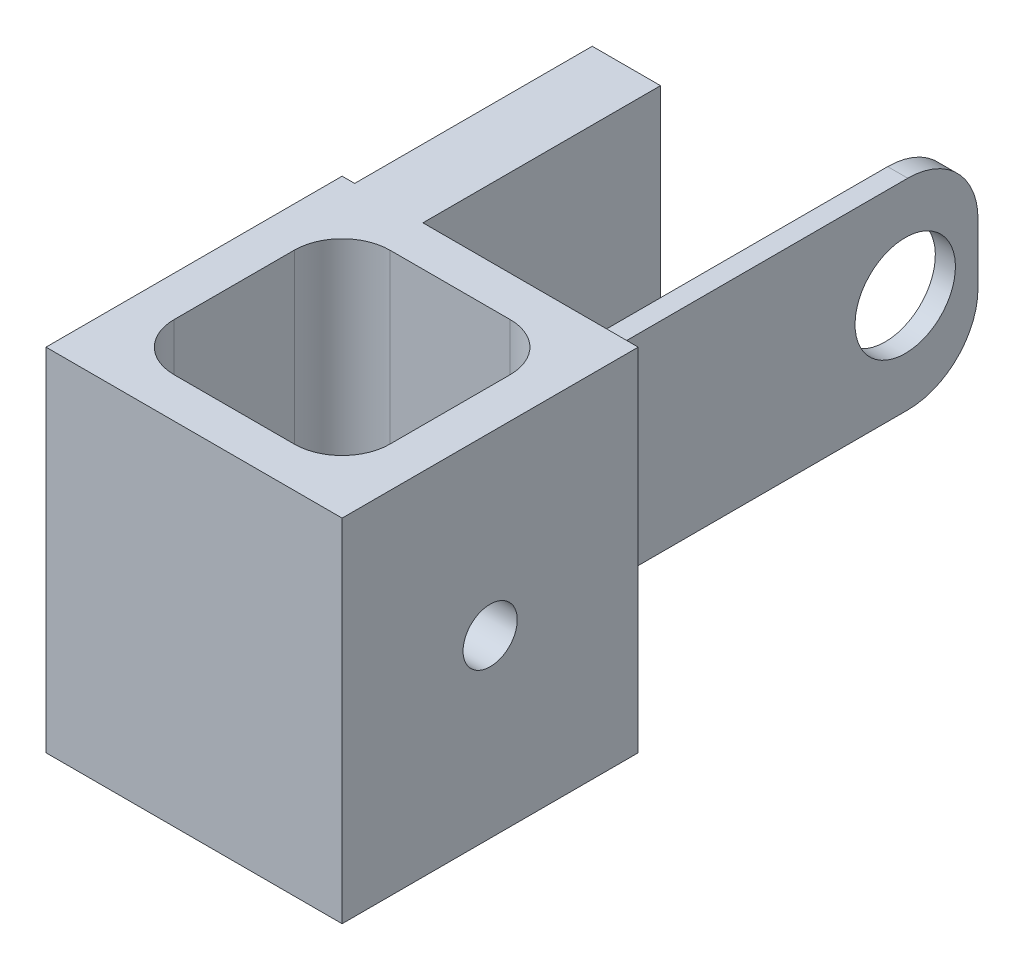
ISO-10303-21;
HEADER;
FILE_DESCRIPTION(('STEP AP214'),'2;1');
FILE_NAME('part.step','',(''),(''),'','','');
FILE_SCHEMA(('AUTOMOTIVE_DESIGN { 1 0 10303 214 1 1 1 1 }'));
ENDSEC;
DATA;
#1=APPLICATION_CONTEXT('core data for automotive mechanical design processes');
#2=APPLICATION_PROTOCOL_DEFINITION('international standard','automotive_design',2000,#1);
#3=PRODUCT_CONTEXT('',#1,'mechanical');
#4=PRODUCT('Part','Part','',(#3));
#5=PRODUCT_RELATED_PRODUCT_CATEGORY('part','',(#4));
#6=PRODUCT_DEFINITION_FORMATION('','',#4);
#7=PRODUCT_DEFINITION_CONTEXT('part definition',#1,'design');
#8=PRODUCT_DEFINITION('design','',#6,#7);
#9=PRODUCT_DEFINITION_SHAPE('','',#8);
#10=(LENGTH_UNIT() NAMED_UNIT(*) SI_UNIT(.MILLI.,.METRE.));
#11=(NAMED_UNIT(*) PLANE_ANGLE_UNIT() SI_UNIT($,.RADIAN.));
#12=(NAMED_UNIT(*) SI_UNIT($,.STERADIAN.) SOLID_ANGLE_UNIT());
#13=UNCERTAINTY_MEASURE_WITH_UNIT(LENGTH_MEASURE(1.E-05),#10,'distance_accuracy_value','');
#14=(GEOMETRIC_REPRESENTATION_CONTEXT(3) GLOBAL_UNCERTAINTY_ASSIGNED_CONTEXT((#13)) GLOBAL_UNIT_ASSIGNED_CONTEXT((#10,
#11,#12)) REPRESENTATION_CONTEXT('',''));
#15=CARTESIAN_POINT('',(0.,0.,0.));
#16=DIRECTION('',(0.,0.,1.));
#17=DIRECTION('',(1.,0.,0.));
#18=AXIS2_PLACEMENT_3D('',#15,#16,#17);
#19=CARTESIAN_POINT('',(0.,-41.7193000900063,-14.75));
#20=DIRECTION('',(0.,0.,1.));
#21=DIRECTION('',(1.,0.,0.));
#22=AXIS2_PLACEMENT_3D('',#19,#20,#21);
#23=PLANE('',#22);
#24=DIRECTION('',(0.,-1.,0.));
#25=VECTOR('',#24,1.);
#26=CARTESIAN_POINT('',(-6.70000000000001,0.,-14.75));
#27=LINE('',#26,#25);
#28=CARTESIAN_POINT('',(-6.70000000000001,35.,-14.75));
#29=VERTEX_POINT('',#28);
#30=CARTESIAN_POINT('',(-6.70000000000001,0.,-14.75));
#31=VERTEX_POINT('',#30);
#32=EDGE_CURVE('E391',#29,#31,#27,.T.);
#33=ORIENTED_EDGE('',*,*,#32,.F.);
#34=DIRECTION('',(1.,0.,0.));
#35=VECTOR('',#34,1.);
#36=CARTESIAN_POINT('',(0.,35.,-14.75));
#37=LINE('',#36,#35);
#38=CARTESIAN_POINT('',(14.75,35.,-14.75));
#39=VERTEX_POINT('',#38);
#40=EDGE_CURVE('E367',#29,#39,#37,.T.);
#41=ORIENTED_EDGE('',*,*,#40,.T.);
#42=DIRECTION('',(0.,1.,0.));
#43=VECTOR('',#42,1.);
#44=CARTESIAN_POINT('',(14.75,-41.7193000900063,-14.75));
#45=LINE('',#44,#43);
#46=CARTESIAN_POINT('',(14.75,0.,-14.75));
#47=VERTEX_POINT('',#46);
#48=EDGE_CURVE('E383',#47,#39,#45,.T.);
#49=ORIENTED_EDGE('',*,*,#48,.F.);
#50=DIRECTION('',(1.,0.,0.));
#51=VECTOR('',#50,1.);
#52=CARTESIAN_POINT('',(0.,0.,-14.75));
#53=LINE('',#52,#51);
#54=EDGE_CURVE('E348',#31,#47,#53,.T.);
#55=ORIENTED_EDGE('',*,*,#54,.F.);
#56=EDGE_LOOP('',(#33,#41,#49,#55));
#57=FACE_BOUND('',#56,.T.);
#58=DIRECTION('',(-1.,0.,0.));
#59=VECTOR('',#58,1.);
#60=CARTESIAN_POINT('',(0.,7.5,-14.75));
#61=LINE('',#60,#59);
#62=CARTESIAN_POINT('',(6.1,7.5,-14.75));
#63=VERTEX_POINT('',#62);
#64=CARTESIAN_POINT('',(4.1,7.5,-14.75));
#65=VERTEX_POINT('',#64);
#66=EDGE_CURVE('E341',#63,#65,#61,.T.);
#67=ORIENTED_EDGE('',*,*,#66,.F.);
#68=DIRECTION('',(0.,-1.,0.));
#69=VECTOR('',#68,1.);
#70=CARTESIAN_POINT('',(6.09999999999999,-41.7193000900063,-14.75));
#71=LINE('',#70,#69);
#72=CARTESIAN_POINT('',(6.1,27.5,-14.75));
#73=VERTEX_POINT('',#72);
#74=EDGE_CURVE('E11',#73,#63,#71,.T.);
#75=ORIENTED_EDGE('',*,*,#74,.F.);
#76=DIRECTION('',(1.,0.,0.));
#77=VECTOR('',#76,1.);
#78=CARTESIAN_POINT('',(0.,27.5,-14.75));
#79=LINE('',#78,#77);
#80=CARTESIAN_POINT('',(4.1,27.5,-14.75));
#81=VERTEX_POINT('',#80);
#82=EDGE_CURVE('E332',#81,#73,#79,.T.);
#83=ORIENTED_EDGE('',*,*,#82,.F.);
#84=DIRECTION('',(0.,1.,0.));
#85=VECTOR('',#84,1.);
#86=CARTESIAN_POINT('',(4.09999999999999,-41.7193000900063,-14.75));
#87=LINE('',#86,#85);
#88=EDGE_CURVE('E345',#65,#81,#87,.T.);
#89=ORIENTED_EDGE('',*,*,#88,.F.);
#90=EDGE_LOOP('',(#67,#75,#83,#89));
#91=FACE_BOUND('',#90,.T.);
#92=ADVANCED_FACE('F39',(#57,#91),#23,.F.);
#93=CARTESIAN_POINT('',(-6.70000000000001,0.,13.751));
#94=DIRECTION('',(1.,0.,0.));
#95=DIRECTION('',(0.,0.,-1.));
#96=AXIS2_PLACEMENT_3D('',#93,#94,#95);
#97=PLANE('',#96);
#98=DIRECTION('',(0.,0.,-1.));
#99=VECTOR('',#98,1.);
#100=CARTESIAN_POINT('',(-6.70000000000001,35.,13.751));
#101=LINE('',#100,#99);
#102=CARTESIAN_POINT('',(-6.70000000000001,35.,-38.42));
#103=VERTEX_POINT('',#102);
#104=EDGE_CURVE('E434',#29,#103,#101,.T.);
#105=ORIENTED_EDGE('',*,*,#104,.F.);
#106=ORIENTED_EDGE('',*,*,#32,.T.);
#107=DIRECTION('',(0.,0.,-1.));
#108=VECTOR('',#107,1.);
#109=CARTESIAN_POINT('',(-6.70000000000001,0.,13.751));
#110=LINE('',#109,#108);
#111=CARTESIAN_POINT('',(-6.70000000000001,0.,-38.42));
#112=VERTEX_POINT('',#111);
#113=EDGE_CURVE('E430',#31,#112,#110,.T.);
#114=ORIENTED_EDGE('',*,*,#113,.T.);
#115=DIRECTION('',(0.,-1.,0.));
#116=VECTOR('',#115,1.);
#117=CARTESIAN_POINT('',(-6.70000000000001,0.,-38.42));
#118=LINE('',#117,#116);
#119=EDGE_CURVE('E418',#103,#112,#118,.T.);
#120=ORIENTED_EDGE('',*,*,#119,.F.);
#121=EDGE_LOOP('',(#105,#106,#114,#120));
#122=FACE_BOUND('',#121,.T.);
#123=ADVANCED_FACE('F516',(#122),#97,.T.);
#124=CARTESIAN_POINT('',(-13.5,0.,13.751));
#125=DIRECTION('',(-1.,0.,0.));
#126=DIRECTION('',(0.,-1.,0.));
#127=AXIS2_PLACEMENT_3D('',#124,#125,#126);
#128=PLANE('',#127);
#129=DIRECTION('',(0.,0.,-1.));
#130=VECTOR('',#129,1.);
#131=CARTESIAN_POINT('',(-13.5,0.,13.751));
#132=LINE('',#131,#130);
#133=CARTESIAN_POINT('',(-13.5,0.,-14.75));
#134=VERTEX_POINT('',#133);
#135=CARTESIAN_POINT('',(-13.5,0.,-38.42));
#136=VERTEX_POINT('',#135);
#137=EDGE_CURVE('E426',#134,#136,#132,.T.);
#138=ORIENTED_EDGE('',*,*,#137,.F.);
#139=DIRECTION('',(0.,1.,0.));
#140=VECTOR('',#139,1.);
#141=CARTESIAN_POINT('',(-13.5,0.,-14.75));
#142=LINE('',#141,#140);
#143=CARTESIAN_POINT('',(-13.5,35.,-14.75));
#144=VERTEX_POINT('',#143);
#145=EDGE_CURVE('E48',#134,#144,#142,.T.);
#146=ORIENTED_EDGE('',*,*,#145,.T.);
#147=DIRECTION('',(0.,0.,-1.));
#148=VECTOR('',#147,1.);
#149=CARTESIAN_POINT('',(-13.5,35.,13.751));
#150=LINE('',#149,#148);
#151=CARTESIAN_POINT('',(-13.5,35.,-38.42));
#152=VERTEX_POINT('',#151);
#153=EDGE_CURVE('E425',#144,#152,#150,.T.);
#154=ORIENTED_EDGE('',*,*,#153,.T.);
#155=DIRECTION('',(0.,1.,0.));
#156=VECTOR('',#155,1.);
#157=CARTESIAN_POINT('',(-13.5,0.,-38.42));
#158=LINE('',#157,#156);
#159=EDGE_CURVE('E411',#136,#152,#158,.T.);
#160=ORIENTED_EDGE('',*,*,#159,.F.);
#161=EDGE_LOOP('',(#138,#146,#154,#160));
#162=FACE_BOUND('',#161,.T.);
#163=ADVANCED_FACE('F41',(#162),#128,.T.);
#164=CARTESIAN_POINT('',(-6.70000000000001,35.,13.751));
#165=DIRECTION('',(0.,1.,0.));
#166=DIRECTION('',(0.,0.,1.));
#167=AXIS2_PLACEMENT_3D('',#164,#165,#166);
#168=PLANE('',#167);
#169=ORIENTED_EDGE('',*,*,#40,.F.);
#170=ORIENTED_EDGE('',*,*,#104,.T.);
#171=DIRECTION('',(1.,0.,0.));
#172=VECTOR('',#171,1.);
#173=CARTESIAN_POINT('',(-6.70000000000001,35.,-38.42));
#174=LINE('',#173,#172);
#175=EDGE_CURVE('E415',#152,#103,#174,.T.);
#176=ORIENTED_EDGE('',*,*,#175,.F.);
#177=ORIENTED_EDGE('',*,*,#153,.F.);
#178=CARTESIAN_POINT('',(-14.75,35.,-14.75));
#179=VERTEX_POINT('',#178);
#180=EDGE_CURVE('E368',#179,#144,#37,.T.);
#181=ORIENTED_EDGE('',*,*,#180,.F.);
#182=DIRECTION('',(0.,0.,-1.));
#183=VECTOR('',#182,1.);
#184=CARTESIAN_POINT('',(-14.75,35.,0.));
#185=LINE('',#184,#183);
#186=CARTESIAN_POINT('',(-14.75,35.,14.75));
#187=VERTEX_POINT('',#186);
#188=EDGE_CURVE('E371',#187,#179,#185,.T.);
#189=ORIENTED_EDGE('',*,*,#188,.F.);
#190=DIRECTION('',(1.,0.,0.));
#191=VECTOR('',#190,1.);
#192=CARTESIAN_POINT('',(0.,35.,14.75));
#193=LINE('',#192,#191);
#194=CARTESIAN_POINT('',(14.75,35.,14.75));
#195=VERTEX_POINT('',#194);
#196=EDGE_CURVE('E360',#187,#195,#193,.T.);
#197=ORIENTED_EDGE('',*,*,#196,.T.);
#198=DIRECTION('',(0.,0.,-1.));
#199=VECTOR('',#198,1.);
#200=CARTESIAN_POINT('',(14.75,35.,0.));
#201=LINE('',#200,#199);
#202=EDGE_CURVE('E364',#195,#39,#201,.T.);
#203=ORIENTED_EDGE('',*,*,#202,.T.);
#204=EDGE_LOOP('',(#169,#170,#176,#177,#181,#189,#197,#203));
#205=FACE_BOUND('',#204,.T.);
#206=CARTESIAN_POINT('',(-5.99,35.,5.99));
#207=DIRECTION('',(0.,1.,0.));
#208=DIRECTION('',(0.,0.,-1.));
#209=AXIS2_PLACEMENT_3D('',#206,#207,#208);
#210=CIRCLE('',#209,4.76);
#211=CARTESIAN_POINT('',(-10.75,35.,5.99));
#212=VERTEX_POINT('',#211);
#213=CARTESIAN_POINT('',(-5.99,35.,10.75));
#214=VERTEX_POINT('',#213);
#215=EDGE_CURVE('E216',#212,#214,#210,.T.);
#216=ORIENTED_EDGE('',*,*,#215,.F.);
#217=DIRECTION('',(0.,0.,1.));
#218=VECTOR('',#217,1.);
#219=CARTESIAN_POINT('',(-10.75,35.,5.99));
#220=LINE('',#219,#218);
#221=CARTESIAN_POINT('',(-10.75,35.,-5.99));
#222=VERTEX_POINT('',#221);
#223=EDGE_CURVE('E254',#222,#212,#220,.T.);
#224=ORIENTED_EDGE('',*,*,#223,.F.);
#225=CARTESIAN_POINT('',(-5.99,35.,-5.99));
#226=DIRECTION('',(0.,1.,0.));
#227=DIRECTION('',(0.,0.,-1.));
#228=AXIS2_PLACEMENT_3D('',#225,#226,#227);
#229=CIRCLE('',#228,4.76);
#230=CARTESIAN_POINT('',(-5.99,35.,-10.75));
#231=VERTEX_POINT('',#230);
#232=EDGE_CURVE('E250',#231,#222,#229,.T.);
#233=ORIENTED_EDGE('',*,*,#232,.F.);
#234=DIRECTION('',(-1.,0.,0.));
#235=VECTOR('',#234,1.);
#236=CARTESIAN_POINT('',(-5.99,35.,-10.75));
#237=LINE('',#236,#235);
#238=CARTESIAN_POINT('',(5.99,35.,-10.75));
#239=VERTEX_POINT('',#238);
#240=EDGE_CURVE('E246',#239,#231,#237,.T.);
#241=ORIENTED_EDGE('',*,*,#240,.F.);
#242=CARTESIAN_POINT('',(5.99,35.,-5.98999999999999));
#243=DIRECTION('',(0.,1.,0.));
#244=DIRECTION('',(0.,0.,-1.));
#245=AXIS2_PLACEMENT_3D('',#242,#243,#244);
#246=CIRCLE('',#245,4.76);
#247=CARTESIAN_POINT('',(10.75,35.,-5.98999999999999));
#248=VERTEX_POINT('',#247);
#249=EDGE_CURVE('E242',#248,#239,#246,.T.);
#250=ORIENTED_EDGE('',*,*,#249,.F.);
#251=DIRECTION('',(0.,0.,-1.));
#252=VECTOR('',#251,1.);
#253=CARTESIAN_POINT('',(10.75,35.,5.99));
#254=LINE('',#253,#252);
#255=CARTESIAN_POINT('',(10.75,35.,5.99));
#256=VERTEX_POINT('',#255);
#257=EDGE_CURVE('E238',#256,#248,#254,.T.);
#258=ORIENTED_EDGE('',*,*,#257,.F.);
#259=CARTESIAN_POINT('',(5.99,35.,5.99));
#260=DIRECTION('',(0.,1.,0.));
#261=DIRECTION('',(0.,0.,1.));
#262=AXIS2_PLACEMENT_3D('',#259,#260,#261);
#263=CIRCLE('',#262,4.76);
#264=CARTESIAN_POINT('',(5.99,35.,10.75));
#265=VERTEX_POINT('',#264);
#266=EDGE_CURVE('E219',#265,#256,#263,.T.);
#267=ORIENTED_EDGE('',*,*,#266,.F.);
#268=DIRECTION('',(1.,0.,0.));
#269=VECTOR('',#268,1.);
#270=CARTESIAN_POINT('',(-5.99,35.,10.75));
#271=LINE('',#270,#269);
#272=EDGE_CURVE('E200',#214,#265,#271,.T.);
#273=ORIENTED_EDGE('',*,*,#272,.F.);
#274=EDGE_LOOP('',(#216,#224,#233,#241,#250,#258,#267,#273));
#275=FACE_BOUND('',#274,.T.);
#276=ADVANCED_FACE('F214',(#205,#275),#168,.T.);
#277=CARTESIAN_POINT('',(-6.70000000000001,0.,13.751));
#278=DIRECTION('',(0.,-1.,0.));
#279=DIRECTION('',(0.,0.,-1.));
#280=AXIS2_PLACEMENT_3D('',#277,#278,#279);
#281=PLANE('',#280);
#282=ORIENTED_EDGE('',*,*,#113,.F.);
#283=ORIENTED_EDGE('',*,*,#54,.T.);
#284=DIRECTION('',(0.,0.,-1.));
#285=VECTOR('',#284,1.);
#286=CARTESIAN_POINT('',(14.75,0.,0.));
#287=LINE('',#286,#285);
#288=CARTESIAN_POINT('',(14.75,0.,14.75));
#289=VERTEX_POINT('',#288);
#290=EDGE_CURVE('E379',#289,#47,#287,.T.);
#291=ORIENTED_EDGE('',*,*,#290,.F.);
#292=DIRECTION('',(1.,0.,0.));
#293=VECTOR('',#292,1.);
#294=CARTESIAN_POINT('',(0.,0.,14.75));
#295=LINE('',#294,#293);
#296=CARTESIAN_POINT('',(-14.75,0.,14.75));
#297=VERTEX_POINT('',#296);
#298=EDGE_CURVE('E356',#297,#289,#295,.T.);
#299=ORIENTED_EDGE('',*,*,#298,.F.);
#300=DIRECTION('',(0.,0.,-1.));
#301=VECTOR('',#300,1.);
#302=CARTESIAN_POINT('',(-14.75,0.,0.));
#303=LINE('',#302,#301);
#304=CARTESIAN_POINT('',(-14.75,0.,-14.75));
#305=VERTEX_POINT('',#304);
#306=EDGE_CURVE('E352',#297,#305,#303,.T.);
#307=ORIENTED_EDGE('',*,*,#306,.T.);
#308=EDGE_CURVE('E349',#305,#134,#53,.T.);
#309=ORIENTED_EDGE('',*,*,#308,.T.);
#310=ORIENTED_EDGE('',*,*,#137,.T.);
#311=DIRECTION('',(-1.,0.,0.));
#312=VECTOR('',#311,1.);
#313=CARTESIAN_POINT('',(-6.70000000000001,0.,-38.42));
#314=LINE('',#313,#312);
#315=EDGE_CURVE('E422',#112,#136,#314,.T.);
#316=ORIENTED_EDGE('',*,*,#315,.F.);
#317=EDGE_LOOP('',(#282,#283,#291,#299,#307,#309,#310,#316));
#318=FACE_BOUND('',#317,.T.);
#319=DIRECTION('',(0.,0.,1.));
#320=VECTOR('',#319,1.);
#321=CARTESIAN_POINT('',(-10.75,0.,5.99));
#322=LINE('',#321,#320);
#323=CARTESIAN_POINT('',(-10.75,0.,-5.99));
#324=VERTEX_POINT('',#323);
#325=CARTESIAN_POINT('',(-10.75,0.,5.99));
#326=VERTEX_POINT('',#325);
#327=EDGE_CURVE('E226',#324,#326,#322,.T.);
#328=ORIENTED_EDGE('',*,*,#327,.T.);
#329=CARTESIAN_POINT('',(-5.99,0.,5.99));
#330=DIRECTION('',(0.,1.,0.));
#331=DIRECTION('',(0.,0.,-1.));
#332=AXIS2_PLACEMENT_3D('',#329,#330,#331);
#333=CIRCLE('',#332,4.76);
#334=CARTESIAN_POINT('',(-5.99,0.,10.75));
#335=VERTEX_POINT('',#334);
#336=EDGE_CURVE('E257',#326,#335,#333,.T.);
#337=ORIENTED_EDGE('',*,*,#336,.T.);
#338=DIRECTION('',(1.,0.,0.));
#339=VECTOR('',#338,1.);
#340=CARTESIAN_POINT('',(-5.99,0.,10.75));
#341=LINE('',#340,#339);
#342=CARTESIAN_POINT('',(5.99,0.,10.75));
#343=VERTEX_POINT('',#342);
#344=EDGE_CURVE('E203',#335,#343,#341,.T.);
#345=ORIENTED_EDGE('',*,*,#344,.T.);
#346=CARTESIAN_POINT('',(5.99,0.,5.99));
#347=DIRECTION('',(0.,1.,0.));
#348=DIRECTION('',(0.,0.,1.));
#349=AXIS2_PLACEMENT_3D('',#346,#347,#348);
#350=CIRCLE('',#349,4.76);
#351=CARTESIAN_POINT('',(10.75,0.,5.99));
#352=VERTEX_POINT('',#351);
#353=EDGE_CURVE('E262',#343,#352,#350,.T.);
#354=ORIENTED_EDGE('',*,*,#353,.T.);
#355=DIRECTION('',(0.,0.,-1.));
#356=VECTOR('',#355,1.);
#357=CARTESIAN_POINT('',(10.75,0.,5.99));
#358=LINE('',#357,#356);
#359=CARTESIAN_POINT('',(10.75,0.,-5.98999999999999));
#360=VERTEX_POINT('',#359);
#361=EDGE_CURVE('E266',#352,#360,#358,.T.);
#362=ORIENTED_EDGE('',*,*,#361,.T.);
#363=CARTESIAN_POINT('',(5.99,0.,-5.98999999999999));
#364=DIRECTION('',(0.,1.,0.));
#365=DIRECTION('',(0.,0.,-1.));
#366=AXIS2_PLACEMENT_3D('',#363,#364,#365);
#367=CIRCLE('',#366,4.76);
#368=CARTESIAN_POINT('',(5.99,0.,-10.75));
#369=VERTEX_POINT('',#368);
#370=EDGE_CURVE('E270',#360,#369,#367,.T.);
#371=ORIENTED_EDGE('',*,*,#370,.T.);
#372=DIRECTION('',(-1.,0.,0.));
#373=VECTOR('',#372,1.);
#374=CARTESIAN_POINT('',(-5.99,0.,-10.75));
#375=LINE('',#374,#373);
#376=CARTESIAN_POINT('',(-5.99,0.,-10.75));
#377=VERTEX_POINT('',#376);
#378=EDGE_CURVE('E274',#369,#377,#375,.T.);
#379=ORIENTED_EDGE('',*,*,#378,.T.);
#380=CARTESIAN_POINT('',(-5.99,0.,-5.99));
#381=DIRECTION('',(0.,1.,0.));
#382=DIRECTION('',(0.,0.,-1.));
#383=AXIS2_PLACEMENT_3D('',#380,#381,#382);
#384=CIRCLE('',#383,4.76);
#385=EDGE_CURVE('E231',#377,#324,#384,.T.);
#386=ORIENTED_EDGE('',*,*,#385,.T.);
#387=EDGE_LOOP('',(#328,#337,#345,#354,#362,#371,#379,#386));
#388=FACE_BOUND('',#387,.T.);
#389=ADVANCED_FACE('F459',(#318,#388),#281,.T.);
#390=CARTESIAN_POINT('',(0.,0.,-38.42));
#391=DIRECTION('',(0.,0.,1.));
#392=DIRECTION('',(1.,0.,0.));
#393=AXIS2_PLACEMENT_3D('',#390,#391,#392);
#394=PLANE('',#393);
#395=CARTESIAN_POINT('',(-10.1,32.,-38.42));
#396=DIRECTION('',(0.,0.,-1.));
#397=DIRECTION('',(-1.,0.,0.));
#398=AXIS2_PLACEMENT_3D('',#395,#396,#397);
#399=CIRCLE('',#398,1.1303);
#400=CARTESIAN_POINT('',(-11.2303,32.,-38.42));
#401=VERTEX_POINT('',#400);
#402=EDGE_CURVE('E395',#401,#401,#399,.T.);
#403=ORIENTED_EDGE('',*,*,#402,.F.);
#404=EDGE_LOOP('',(#403));
#405=FACE_BOUND('',#404,.T.);
#406=CARTESIAN_POINT('',(-10.1,3.,-38.42));
#407=DIRECTION('',(0.,0.,-1.));
#408=DIRECTION('',(-1.,0.,0.));
#409=AXIS2_PLACEMENT_3D('',#406,#407,#408);
#410=CIRCLE('',#409,1.1303);
#411=CARTESIAN_POINT('',(-11.2303,3.,-38.42));
#412=VERTEX_POINT('',#411);
#413=EDGE_CURVE('E403',#412,#412,#410,.T.);
#414=ORIENTED_EDGE('',*,*,#413,.F.);
#415=EDGE_LOOP('',(#414));
#416=FACE_BOUND('',#415,.T.);
#417=ORIENTED_EDGE('',*,*,#159,.T.);
#418=ORIENTED_EDGE('',*,*,#175,.T.);
#419=ORIENTED_EDGE('',*,*,#119,.T.);
#420=ORIENTED_EDGE('',*,*,#315,.T.);
#421=EDGE_LOOP('',(#417,#418,#419,#420));
#422=FACE_BOUND('',#421,.T.);
#423=ADVANCED_FACE('F457',(#405,#416,#422),#394,.F.);
#424=CARTESIAN_POINT('',(-10.1,3.,-18.42));
#425=DIRECTION('',(0.,0.,-1.));
#426=DIRECTION('',(-1.,0.,0.));
#427=AXIS2_PLACEMENT_3D('',#424,#425,#426);
#428=CONICAL_SURFACE('',#427,1.1303,1.02974425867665);
#429=CARTESIAN_POINT('',(-10.1,3.,-17.7408472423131));
#430=VERTEX_POINT('',#429);
#431=VERTEX_LOOP('',#430);
#432=FACE_BOUND('',#431,.T.);
#433=CARTESIAN_POINT('',(-10.1,3.,-18.42));
#434=DIRECTION('',(0.,0.,-1.));
#435=DIRECTION('',(-1.,0.,0.));
#436=AXIS2_PLACEMENT_3D('',#433,#434,#435);
#437=CIRCLE('',#436,1.1303);
#438=CARTESIAN_POINT('',(-11.2303,3.,-18.42));
#439=VERTEX_POINT('',#438);
#440=EDGE_CURVE('E407',#439,#439,#437,.T.);
#441=ORIENTED_EDGE('',*,*,#440,.T.);
#442=EDGE_LOOP('',(#441));
#443=FACE_BOUND('',#442,.T.);
#444=ADVANCED_FACE('F533',(#432,#443),#428,.F.);
#445=CARTESIAN_POINT('',(-10.1,3.,-38.42));
#446=DIRECTION('',(0.,0.,-1.));
#447=DIRECTION('',(-1.,0.,0.));
#448=AXIS2_PLACEMENT_3D('',#445,#446,#447);
#449=CYLINDRICAL_SURFACE('',#448,1.1303);
#450=ORIENTED_EDGE('',*,*,#440,.F.);
#451=EDGE_LOOP('',(#450));
#452=FACE_BOUND('',#451,.T.);
#453=ORIENTED_EDGE('',*,*,#413,.T.);
#454=EDGE_LOOP('',(#453));
#455=FACE_BOUND('',#454,.T.);
#456=ADVANCED_FACE('F538',(#452,#455),#449,.F.);
#457=CARTESIAN_POINT('',(-10.1,32.,-18.42));
#458=DIRECTION('',(0.,0.,-1.));
#459=DIRECTION('',(-1.,0.,0.));
#460=AXIS2_PLACEMENT_3D('',#457,#458,#459);
#461=CONICAL_SURFACE('',#460,1.1303,1.02974425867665);
#462=CARTESIAN_POINT('',(-10.1,32.,-17.7408472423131));
#463=VERTEX_POINT('',#462);
#464=VERTEX_LOOP('',#463);
#465=FACE_BOUND('',#464,.T.);
#466=CARTESIAN_POINT('',(-10.1,32.,-18.42));
#467=DIRECTION('',(0.,0.,-1.));
#468=DIRECTION('',(-1.,0.,0.));
#469=AXIS2_PLACEMENT_3D('',#466,#467,#468);
#470=CIRCLE('',#469,1.1303);
#471=CARTESIAN_POINT('',(-11.2303,32.,-18.42));
#472=VERTEX_POINT('',#471);
#473=EDGE_CURVE('E399',#472,#472,#470,.T.);
#474=ORIENTED_EDGE('',*,*,#473,.T.);
#475=EDGE_LOOP('',(#474));
#476=FACE_BOUND('',#475,.T.);
#477=ADVANCED_FACE('F546',(#465,#476),#461,.F.);
#478=CARTESIAN_POINT('',(-10.1,32.,-38.42));
#479=DIRECTION('',(0.,0.,-1.));
#480=DIRECTION('',(-1.,0.,0.));
#481=AXIS2_PLACEMENT_3D('',#478,#479,#480);
#482=CYLINDRICAL_SURFACE('',#481,1.1303);
#483=ORIENTED_EDGE('',*,*,#473,.F.);
#484=EDGE_LOOP('',(#483));
#485=FACE_BOUND('',#484,.T.);
#486=ORIENTED_EDGE('',*,*,#402,.T.);
#487=EDGE_LOOP('',(#486));
#488=FACE_BOUND('',#487,.T.);
#489=ADVANCED_FACE('F550',(#485,#488),#482,.F.);
#490=CARTESIAN_POINT('',(14.75,-41.7193000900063,0.));
#491=DIRECTION('',(1.,0.,0.));
#492=DIRECTION('',(0.,0.,-1.));
#493=AXIS2_PLACEMENT_3D('',#490,#491,#492);
#494=PLANE('',#493);
#495=CARTESIAN_POINT('',(14.75,17.5,0.));
#496=DIRECTION('',(-1.,0.,0.));
#497=DIRECTION('',(0.,0.,1.));
#498=AXIS2_PLACEMENT_3D('',#495,#496,#497);
#499=CIRCLE('',#498,2.7);
#500=CARTESIAN_POINT('',(14.75,17.5,2.7));
#501=VERTEX_POINT('',#500);
#502=EDGE_CURVE('E338',#501,#501,#499,.T.);
#503=ORIENTED_EDGE('',*,*,#502,.T.);
#504=EDGE_LOOP('',(#503));
#505=FACE_BOUND('',#504,.T.);
#506=DIRECTION('',(0.,1.,0.));
#507=VECTOR('',#506,1.);
#508=CARTESIAN_POINT('',(14.75,-41.7193000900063,14.75));
#509=LINE('',#508,#507);
#510=EDGE_CURVE('E375',#289,#195,#509,.T.);
#511=ORIENTED_EDGE('',*,*,#510,.F.);
#512=ORIENTED_EDGE('',*,*,#290,.T.);
#513=ORIENTED_EDGE('',*,*,#48,.T.);
#514=ORIENTED_EDGE('',*,*,#202,.F.);
#515=EDGE_LOOP('',(#511,#512,#513,#514));
#516=FACE_BOUND('',#515,.T.);
#517=ADVANCED_FACE('F471',(#505,#516),#494,.T.);
#518=ORIENTED_EDGE('',*,*,#145,.F.);
#519=ORIENTED_EDGE('',*,*,#308,.F.);
#520=DIRECTION('',(0.,1.,0.));
#521=VECTOR('',#520,1.);
#522=CARTESIAN_POINT('',(-14.75,-41.7193000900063,-14.75));
#523=LINE('',#522,#521);
#524=EDGE_CURVE('E380',#305,#179,#523,.T.);
#525=ORIENTED_EDGE('',*,*,#524,.T.);
#526=ORIENTED_EDGE('',*,*,#180,.T.);
#527=EDGE_LOOP('',(#518,#519,#525,#526));
#528=FACE_BOUND('',#527,.T.);
#529=ADVANCED_FACE('F450',(#528),#23,.F.);
#530=CARTESIAN_POINT('',(-14.75,-41.7193000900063,0.));
#531=DIRECTION('',(1.,0.,0.));
#532=DIRECTION('',(0.,0.,-1.));
#533=AXIS2_PLACEMENT_3D('',#530,#531,#532);
#534=PLANE('',#533);
#535=CARTESIAN_POINT('',(-14.75,17.5,0.));
#536=DIRECTION('',(-1.,0.,0.));
#537=DIRECTION('',(0.,0.,1.));
#538=AXIS2_PLACEMENT_3D('',#535,#536,#537);
#539=CIRCLE('',#538,2.7);
#540=CARTESIAN_POINT('',(-14.75,17.5,2.7));
#541=VERTEX_POINT('',#540);
#542=EDGE_CURVE('E640',#541,#541,#539,.T.);
#543=ORIENTED_EDGE('',*,*,#542,.F.);
#544=EDGE_LOOP('',(#543));
#545=FACE_BOUND('',#544,.T.);
#546=ORIENTED_EDGE('',*,*,#306,.F.);
#547=DIRECTION('',(0.,1.,0.));
#548=VECTOR('',#547,1.);
#549=CARTESIAN_POINT('',(-14.75,-41.7193000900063,14.75));
#550=LINE('',#549,#548);
#551=EDGE_CURVE('E376',#297,#187,#550,.T.);
#552=ORIENTED_EDGE('',*,*,#551,.T.);
#553=ORIENTED_EDGE('',*,*,#188,.T.);
#554=ORIENTED_EDGE('',*,*,#524,.F.);
#555=EDGE_LOOP('',(#546,#552,#553,#554));
#556=FACE_BOUND('',#555,.T.);
#557=ADVANCED_FACE('F465',(#545,#556),#534,.F.);
#558=CARTESIAN_POINT('',(0.,-41.7193000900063,14.75));
#559=DIRECTION('',(0.,0.,1.));
#560=DIRECTION('',(1.,0.,0.));
#561=AXIS2_PLACEMENT_3D('',#558,#559,#560);
#562=PLANE('',#561);
#563=ORIENTED_EDGE('',*,*,#551,.F.);
#564=ORIENTED_EDGE('',*,*,#298,.T.);
#565=ORIENTED_EDGE('',*,*,#510,.T.);
#566=ORIENTED_EDGE('',*,*,#196,.F.);
#567=EDGE_LOOP('',(#563,#564,#565,#566));
#568=FACE_BOUND('',#567,.T.);
#569=ADVANCED_FACE('F469',(#568),#562,.T.);
#570=CARTESIAN_POINT('',(-5.99,35.,-5.99));
#571=DIRECTION('',(0.,-1.,0.));
#572=DIRECTION('',(0.,0.,-1.));
#573=AXIS2_PLACEMENT_3D('',#570,#571,#572);
#574=CYLINDRICAL_SURFACE('',#573,4.76);
#575=ORIENTED_EDGE('',*,*,#385,.F.);
#576=DIRECTION('',(0.,-1.,0.));
#577=VECTOR('',#576,1.);
#578=CARTESIAN_POINT('',(-5.99,35.,-10.75));
#579=LINE('',#578,#577);
#580=EDGE_CURVE('E286',#231,#377,#579,.T.);
#581=ORIENTED_EDGE('',*,*,#580,.F.);
#582=ORIENTED_EDGE('',*,*,#232,.T.);
#583=DIRECTION('',(0.,-1.,0.));
#584=VECTOR('',#583,1.);
#585=CARTESIAN_POINT('',(-10.75,35.,-5.99));
#586=LINE('',#585,#584);
#587=EDGE_CURVE('E283',#222,#324,#586,.T.);
#588=ORIENTED_EDGE('',*,*,#587,.T.);
#589=EDGE_LOOP('',(#575,#581,#582,#588));
#590=FACE_BOUND('',#589,.T.);
#591=ADVANCED_FACE('F557',(#590),#574,.F.);
#592=CARTESIAN_POINT('',(-5.99,35.,-10.75));
#593=DIRECTION('',(0.,0.,1.));
#594=DIRECTION('',(1.,0.,0.));
#595=AXIS2_PLACEMENT_3D('',#592,#593,#594);
#596=PLANE('',#595);
#597=ORIENTED_EDGE('',*,*,#378,.F.);
#598=DIRECTION('',(0.,-1.,0.));
#599=VECTOR('',#598,1.);
#600=CARTESIAN_POINT('',(5.99,35.,-10.75));
#601=LINE('',#600,#599);
#602=EDGE_CURVE('E289',#239,#369,#601,.T.);
#603=ORIENTED_EDGE('',*,*,#602,.F.);
#604=ORIENTED_EDGE('',*,*,#240,.T.);
#605=ORIENTED_EDGE('',*,*,#580,.T.);
#606=EDGE_LOOP('',(#597,#603,#604,#605));
#607=FACE_BOUND('',#606,.T.);
#608=ADVANCED_FACE('F592',(#607),#596,.T.);
#609=CARTESIAN_POINT('',(5.99,35.,-5.98999999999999));
#610=DIRECTION('',(0.,-1.,0.));
#611=DIRECTION('',(0.,0.,-1.));
#612=AXIS2_PLACEMENT_3D('',#609,#610,#611);
#613=CYLINDRICAL_SURFACE('',#612,4.76);
#614=ORIENTED_EDGE('',*,*,#370,.F.);
#615=DIRECTION('',(0.,-1.,0.));
#616=VECTOR('',#615,1.);
#617=CARTESIAN_POINT('',(10.75,35.,-5.98999999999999));
#618=LINE('',#617,#616);
#619=EDGE_CURVE('E292',#248,#360,#618,.T.);
#620=ORIENTED_EDGE('',*,*,#619,.F.);
#621=ORIENTED_EDGE('',*,*,#249,.T.);
#622=ORIENTED_EDGE('',*,*,#602,.T.);
#623=EDGE_LOOP('',(#614,#620,#621,#622));
#624=FACE_BOUND('',#623,.T.);
#625=ADVANCED_FACE('F582',(#624),#613,.F.);
#626=CARTESIAN_POINT('',(5.99,35.,5.99));
#627=DIRECTION('',(0.,-1.,0.));
#628=DIRECTION('',(0.,0.,-1.));
#629=AXIS2_PLACEMENT_3D('',#626,#627,#628);
#630=CYLINDRICAL_SURFACE('',#629,4.76);
#631=ORIENTED_EDGE('',*,*,#353,.F.);
#632=DIRECTION('',(0.,-1.,0.));
#633=VECTOR('',#632,1.);
#634=CARTESIAN_POINT('',(5.99,35.,10.75));
#635=LINE('',#634,#633);
#636=EDGE_CURVE('E210',#265,#343,#635,.T.);
#637=ORIENTED_EDGE('',*,*,#636,.F.);
#638=ORIENTED_EDGE('',*,*,#266,.T.);
#639=DIRECTION('',(0.,-1.,0.));
#640=VECTOR('',#639,1.);
#641=CARTESIAN_POINT('',(10.75,35.,5.99));
#642=LINE('',#641,#640);
#643=EDGE_CURVE('E295',#256,#352,#642,.T.);
#644=ORIENTED_EDGE('',*,*,#643,.T.);
#645=EDGE_LOOP('',(#631,#637,#638,#644));
#646=FACE_BOUND('',#645,.T.);
#647=ADVANCED_FACE('F579',(#646),#630,.F.);
#648=CARTESIAN_POINT('',(-5.99,35.,10.75));
#649=DIRECTION('',(0.,0.,-1.));
#650=DIRECTION('',(-1.,0.,0.));
#651=AXIS2_PLACEMENT_3D('',#648,#649,#650);
#652=PLANE('',#651);
#653=ORIENTED_EDGE('',*,*,#344,.F.);
#654=DIRECTION('',(0.,-1.,0.));
#655=VECTOR('',#654,1.);
#656=CARTESIAN_POINT('',(-5.99,35.,10.75));
#657=LINE('',#656,#655);
#658=EDGE_CURVE('E197',#214,#335,#657,.T.);
#659=ORIENTED_EDGE('',*,*,#658,.F.);
#660=ORIENTED_EDGE('',*,*,#272,.T.);
#661=ORIENTED_EDGE('',*,*,#636,.T.);
#662=EDGE_LOOP('',(#653,#659,#660,#661));
#663=FACE_BOUND('',#662,.T.);
#664=ADVANCED_FACE('F199',(#663),#652,.T.);
#665=CARTESIAN_POINT('',(-5.99,35.,5.99));
#666=DIRECTION('',(0.,-1.,0.));
#667=DIRECTION('',(0.,0.,-1.));
#668=AXIS2_PLACEMENT_3D('',#665,#666,#667);
#669=CYLINDRICAL_SURFACE('',#668,4.76);
#670=ORIENTED_EDGE('',*,*,#336,.F.);
#671=DIRECTION('',(0.,-1.,0.));
#672=VECTOR('',#671,1.);
#673=CARTESIAN_POINT('',(-10.75,35.,5.99));
#674=LINE('',#673,#672);
#675=EDGE_CURVE('E223',#212,#326,#674,.T.);
#676=ORIENTED_EDGE('',*,*,#675,.F.);
#677=ORIENTED_EDGE('',*,*,#215,.T.);
#678=ORIENTED_EDGE('',*,*,#658,.T.);
#679=EDGE_LOOP('',(#670,#676,#677,#678));
#680=FACE_BOUND('',#679,.T.);
#681=ADVANCED_FACE('F222',(#680),#669,.F.);
#682=CARTESIAN_POINT('',(-13.75,17.5,0.));
#683=DIRECTION('',(1.,0.,0.));
#684=DIRECTION('',(0.,0.,-1.));
#685=AXIS2_PLACEMENT_3D('',#682,#683,#684);
#686=CYLINDRICAL_SURFACE('',#685,2.7);
#687=CARTESIAN_POINT('',(-10.75,17.5,0.));
#688=DIRECTION('',(1.,0.,0.));
#689=DIRECTION('',(0.,0.,-1.));
#690=AXIS2_PLACEMENT_3D('',#687,#688,#689);
#691=CIRCLE('',#690,2.7);
#692=CARTESIAN_POINT('',(-10.75,17.5,-2.7));
#693=VERTEX_POINT('',#692);
#694=EDGE_CURVE('E333',#693,#693,#691,.T.);
#695=ORIENTED_EDGE('',*,*,#694,.T.);
#696=EDGE_LOOP('',(#695));
#697=FACE_BOUND('',#696,.T.);
#698=ORIENTED_EDGE('',*,*,#542,.T.);
#699=EDGE_LOOP('',(#698));
#700=FACE_BOUND('',#699,.T.);
#701=ADVANCED_FACE('F576',(#697,#700),#686,.F.);
#702=CARTESIAN_POINT('',(-10.75,35.,5.99));
#703=DIRECTION('',(1.,0.,0.));
#704=DIRECTION('',(0.,0.,-1.));
#705=AXIS2_PLACEMENT_3D('',#702,#703,#704);
#706=PLANE('',#705);
#707=ORIENTED_EDGE('',*,*,#694,.F.);
#708=EDGE_LOOP('',(#707));
#709=FACE_BOUND('',#708,.T.);
#710=ORIENTED_EDGE('',*,*,#327,.F.);
#711=ORIENTED_EDGE('',*,*,#587,.F.);
#712=ORIENTED_EDGE('',*,*,#223,.T.);
#713=ORIENTED_EDGE('',*,*,#675,.T.);
#714=EDGE_LOOP('',(#710,#711,#712,#713));
#715=FACE_BOUND('',#714,.T.);
#716=ADVANCED_FACE('F588',(#709,#715),#706,.T.);
#717=CARTESIAN_POINT('',(10.75,35.,5.99));
#718=DIRECTION('',(-1.,0.,0.));
#719=DIRECTION('',(0.,0.,1.));
#720=AXIS2_PLACEMENT_3D('',#717,#718,#719);
#721=PLANE('',#720);
#722=CARTESIAN_POINT('',(10.75,17.5,0.));
#723=DIRECTION('',(-1.,0.,0.));
#724=DIRECTION('',(0.,0.,1.));
#725=AXIS2_PLACEMENT_3D('',#722,#723,#724);
#726=CIRCLE('',#725,2.7);
#727=CARTESIAN_POINT('',(10.75,17.5,2.7));
#728=VERTEX_POINT('',#727);
#729=EDGE_CURVE('E337',#728,#728,#726,.T.);
#730=ORIENTED_EDGE('',*,*,#729,.F.);
#731=EDGE_LOOP('',(#730));
#732=FACE_BOUND('',#731,.T.);
#733=ORIENTED_EDGE('',*,*,#361,.F.);
#734=ORIENTED_EDGE('',*,*,#643,.F.);
#735=ORIENTED_EDGE('',*,*,#257,.T.);
#736=ORIENTED_EDGE('',*,*,#619,.T.);
#737=EDGE_LOOP('',(#733,#734,#735,#736));
#738=FACE_BOUND('',#737,.T.);
#739=ADVANCED_FACE('F584',(#732,#738),#721,.T.);
#740=ORIENTED_EDGE('',*,*,#729,.T.);
#741=EDGE_LOOP('',(#740));
#742=FACE_BOUND('',#741,.T.);
#743=ORIENTED_EDGE('',*,*,#502,.F.);
#744=EDGE_LOOP('',(#743));
#745=FACE_BOUND('',#744,.T.);
#746=ADVANCED_FACE('F587',(#742,#745),#686,.F.);
#747=CARTESIAN_POINT('',(6.1,27.5,-57.25));
#748=DIRECTION('',(-1.,0.,0.));
#749=DIRECTION('',(0.,-1.,0.));
#750=AXIS2_PLACEMENT_3D('',#747,#748,#749);
#751=PLANE('',#750);
#752=CARTESIAN_POINT('',(6.1,17.5,-50.));
#753=DIRECTION('',(-1.,0.,0.));
#754=DIRECTION('',(0.,-1.,0.));
#755=AXIS2_PLACEMENT_3D('',#752,#753,#754);
#756=CIRCLE('',#755,5.);
#757=CARTESIAN_POINT('',(6.1,12.5,-50.));
#758=VERTEX_POINT('',#757);
#759=EDGE_CURVE('E300',#758,#758,#756,.T.);
#760=ORIENTED_EDGE('',*,*,#759,.T.);
#761=EDGE_LOOP('',(#760));
#762=FACE_BOUND('',#761,.T.);
#763=DIRECTION('',(0.,0.,1.));
#764=VECTOR('',#763,1.);
#765=CARTESIAN_POINT('',(6.1,27.5,-57.25));
#766=LINE('',#765,#764);
#767=CARTESIAN_POINT('',(6.1,27.5,-50.25));
#768=VERTEX_POINT('',#767);
#769=EDGE_CURVE('E662',#768,#73,#766,.T.);
#770=ORIENTED_EDGE('',*,*,#769,.T.);
#771=ORIENTED_EDGE('',*,*,#74,.T.);
#772=DIRECTION('',(0.,0.,1.));
#773=VECTOR('',#772,1.);
#774=CARTESIAN_POINT('',(6.1,7.5,-57.25));
#775=LINE('',#774,#773);
#776=CARTESIAN_POINT('',(6.1,7.5,-50.25));
#777=VERTEX_POINT('',#776);
#778=EDGE_CURVE('E659',#777,#63,#775,.T.);
#779=ORIENTED_EDGE('',*,*,#778,.F.);
#780=CARTESIAN_POINT('',(6.1,14.5,-50.25));
#781=DIRECTION('',(-1.,0.,0.));
#782=DIRECTION('',(0.,-1.,0.));
#783=AXIS2_PLACEMENT_3D('',#780,#781,#782);
#784=CIRCLE('',#783,7.);
#785=CARTESIAN_POINT('',(6.1,14.5,-57.25));
#786=VERTEX_POINT('',#785);
#787=EDGE_CURVE('E325',#777,#786,#784,.F.);
#788=ORIENTED_EDGE('',*,*,#787,.T.);
#789=DIRECTION('',(0.,-1.,0.));
#790=VECTOR('',#789,1.);
#791=CARTESIAN_POINT('',(6.1,27.5,-57.25));
#792=LINE('',#791,#790);
#793=CARTESIAN_POINT('',(6.1,20.5,-57.25));
#794=VERTEX_POINT('',#793);
#795=EDGE_CURVE('E655',#794,#786,#792,.T.);
#796=ORIENTED_EDGE('',*,*,#795,.F.);
#797=CARTESIAN_POINT('',(6.1,20.5,-50.25));
#798=DIRECTION('',(-1.,0.,0.));
#799=DIRECTION('',(0.,-1.,0.));
#800=AXIS2_PLACEMENT_3D('',#797,#798,#799);
#801=CIRCLE('',#800,7.);
#802=EDGE_CURVE('E321',#794,#768,#801,.F.);
#803=ORIENTED_EDGE('',*,*,#802,.T.);
#804=EDGE_LOOP('',(#770,#771,#779,#788,#796,#803));
#805=FACE_BOUND('',#804,.T.);
#806=ADVANCED_FACE('F611',(#762,#805),#751,.F.);
#807=CARTESIAN_POINT('',(4.1,7.5,-57.25));
#808=DIRECTION('',(1.,0.,0.));
#809=DIRECTION('',(0.,1.,0.));
#810=AXIS2_PLACEMENT_3D('',#807,#808,#809);
#811=PLANE('',#810);
#812=CARTESIAN_POINT('',(4.1,17.5,-50.));
#813=DIRECTION('',(-1.,0.,0.));
#814=DIRECTION('',(0.,-1.,0.));
#815=AXIS2_PLACEMENT_3D('',#812,#813,#814);
#816=CIRCLE('',#815,5.);
#817=CARTESIAN_POINT('',(4.1,12.5,-50.));
#818=VERTEX_POINT('',#817);
#819=EDGE_CURVE('E305',#818,#818,#816,.T.);
#820=ORIENTED_EDGE('',*,*,#819,.F.);
#821=EDGE_LOOP('',(#820));
#822=FACE_BOUND('',#821,.T.);
#823=DIRECTION('',(0.,0.,1.));
#824=VECTOR('',#823,1.);
#825=CARTESIAN_POINT('',(4.1,7.5,-57.25));
#826=LINE('',#825,#824);
#827=CARTESIAN_POINT('',(4.1,7.5,-50.25));
#828=VERTEX_POINT('',#827);
#829=EDGE_CURVE('E55',#828,#65,#826,.T.);
#830=ORIENTED_EDGE('',*,*,#829,.T.);
#831=ORIENTED_EDGE('',*,*,#88,.T.);
#832=DIRECTION('',(0.,0.,1.));
#833=VECTOR('',#832,1.);
#834=CARTESIAN_POINT('',(4.1,27.5,-57.25));
#835=LINE('',#834,#833);
#836=CARTESIAN_POINT('',(4.1,27.5,-50.25));
#837=VERTEX_POINT('',#836);
#838=EDGE_CURVE('E63',#837,#81,#835,.T.);
#839=ORIENTED_EDGE('',*,*,#838,.F.);
#840=CARTESIAN_POINT('',(4.1,20.5,-50.25));
#841=DIRECTION('',(1.,0.,0.));
#842=DIRECTION('',(0.,1.,0.));
#843=AXIS2_PLACEMENT_3D('',#840,#841,#842);
#844=CIRCLE('',#843,7.);
#845=CARTESIAN_POINT('',(4.1,20.5,-57.25));
#846=VERTEX_POINT('',#845);
#847=EDGE_CURVE('E311',#837,#846,#844,.F.);
#848=ORIENTED_EDGE('',*,*,#847,.T.);
#849=DIRECTION('',(0.,1.,0.));
#850=VECTOR('',#849,1.);
#851=CARTESIAN_POINT('',(4.1,7.5,-57.25));
#852=LINE('',#851,#850);
#853=CARTESIAN_POINT('',(4.1,14.5,-57.25));
#854=VERTEX_POINT('',#853);
#855=EDGE_CURVE('E304',#854,#846,#852,.T.);
#856=ORIENTED_EDGE('',*,*,#855,.F.);
#857=CARTESIAN_POINT('',(4.1,14.5,-50.25));
#858=DIRECTION('',(1.,0.,0.));
#859=DIRECTION('',(0.,1.,0.));
#860=AXIS2_PLACEMENT_3D('',#857,#858,#859);
#861=CIRCLE('',#860,7.);
#862=EDGE_CURVE('E315',#854,#828,#861,.F.);
#863=ORIENTED_EDGE('',*,*,#862,.T.);
#864=EDGE_LOOP('',(#830,#831,#839,#848,#856,#863));
#865=FACE_BOUND('',#864,.T.);
#866=ADVANCED_FACE('F607',(#822,#865),#811,.F.);
#867=CARTESIAN_POINT('',(4.1,7.5,-57.25));
#868=DIRECTION('',(0.,1.,0.));
#869=DIRECTION('',(0.,0.,1.));
#870=AXIS2_PLACEMENT_3D('',#867,#868,#869);
#871=PLANE('',#870);
#872=ORIENTED_EDGE('',*,*,#778,.T.);
#873=ORIENTED_EDGE('',*,*,#66,.T.);
#874=ORIENTED_EDGE('',*,*,#829,.F.);
#875=DIRECTION('',(-1.,0.,0.));
#876=VECTOR('',#875,1.);
#877=CARTESIAN_POINT('',(6.1,7.5,-50.25));
#878=LINE('',#877,#876);
#879=EDGE_CURVE('E318',#828,#777,#878,.F.);
#880=ORIENTED_EDGE('',*,*,#879,.T.);
#881=EDGE_LOOP('',(#872,#873,#874,#880));
#882=FACE_BOUND('',#881,.T.);
#883=ADVANCED_FACE('F603',(#882),#871,.F.);
#884=CARTESIAN_POINT('',(4.1,27.5,-57.25));
#885=DIRECTION('',(0.,-1.,0.));
#886=DIRECTION('',(0.,0.,-1.));
#887=AXIS2_PLACEMENT_3D('',#884,#885,#886);
#888=PLANE('',#887);
#889=ORIENTED_EDGE('',*,*,#838,.T.);
#890=ORIENTED_EDGE('',*,*,#82,.T.);
#891=ORIENTED_EDGE('',*,*,#769,.F.);
#892=DIRECTION('',(1.,0.,0.));
#893=VECTOR('',#892,1.);
#894=CARTESIAN_POINT('',(4.1,27.5,-50.25));
#895=LINE('',#894,#893);
#896=EDGE_CURVE('E329',#768,#837,#895,.F.);
#897=ORIENTED_EDGE('',*,*,#896,.T.);
#898=EDGE_LOOP('',(#889,#890,#891,#897));
#899=FACE_BOUND('',#898,.T.);
#900=ADVANCED_FACE('F606',(#899),#888,.F.);
#901=CARTESIAN_POINT('',(0.,0.,-57.25));
#902=DIRECTION('',(0.,0.,-1.));
#903=DIRECTION('',(-1.,0.,0.));
#904=AXIS2_PLACEMENT_3D('',#901,#902,#903);
#905=PLANE('',#904);
#906=ORIENTED_EDGE('',*,*,#795,.T.);
#907=DIRECTION('',(-1.,0.,0.));
#908=VECTOR('',#907,1.);
#909=CARTESIAN_POINT('',(4.1,14.5,-57.25));
#910=LINE('',#909,#908);
#911=EDGE_CURVE('E308',#786,#854,#910,.T.);
#912=ORIENTED_EDGE('',*,*,#911,.T.);
#913=ORIENTED_EDGE('',*,*,#855,.T.);
#914=DIRECTION('',(1.,0.,0.));
#915=VECTOR('',#914,1.);
#916=CARTESIAN_POINT('',(6.1,20.5,-57.25));
#917=LINE('',#916,#915);
#918=EDGE_CURVE('E209',#846,#794,#917,.T.);
#919=ORIENTED_EDGE('',*,*,#918,.T.);
#920=EDGE_LOOP('',(#906,#912,#913,#919));
#921=FACE_BOUND('',#920,.T.);
#922=ADVANCED_FACE('F615',(#921),#905,.T.);
#923=CARTESIAN_POINT('',(13.75,17.5,-50.));
#924=DIRECTION('',(-1.,0.,0.));
#925=DIRECTION('',(0.,-1.,0.));
#926=AXIS2_PLACEMENT_3D('',#923,#924,#925);
#927=CYLINDRICAL_SURFACE('',#926,5.);
#928=ORIENTED_EDGE('',*,*,#819,.T.);
#929=EDGE_LOOP('',(#928));
#930=FACE_BOUND('',#929,.T.);
#931=ORIENTED_EDGE('',*,*,#759,.F.);
#932=EDGE_LOOP('',(#931));
#933=FACE_BOUND('',#932,.T.);
#934=ADVANCED_FACE('F572',(#930,#933),#927,.F.);
#935=CARTESIAN_POINT('',(0.,14.5,-50.25));
#936=DIRECTION('',(1.,0.,0.));
#937=DIRECTION('',(0.,0.,-1.));
#938=AXIS2_PLACEMENT_3D('',#935,#936,#937);
#939=CYLINDRICAL_SURFACE('',#938,7.);
#940=ORIENTED_EDGE('',*,*,#787,.F.);
#941=ORIENTED_EDGE('',*,*,#879,.F.);
#942=ORIENTED_EDGE('',*,*,#862,.F.);
#943=ORIENTED_EDGE('',*,*,#911,.F.);
#944=EDGE_LOOP('',(#940,#941,#942,#943));
#945=FACE_BOUND('',#944,.T.);
#946=ADVANCED_FACE('F568',(#945),#939,.T.);
#947=CARTESIAN_POINT('',(0.,20.5,-50.25));
#948=DIRECTION('',(-1.,0.,0.));
#949=DIRECTION('',(0.,0.,1.));
#950=AXIS2_PLACEMENT_3D('',#947,#948,#949);
#951=CYLINDRICAL_SURFACE('',#950,7.);
#952=ORIENTED_EDGE('',*,*,#847,.F.);
#953=ORIENTED_EDGE('',*,*,#896,.F.);
#954=ORIENTED_EDGE('',*,*,#802,.F.);
#955=ORIENTED_EDGE('',*,*,#918,.F.);
#956=EDGE_LOOP('',(#952,#953,#954,#955));
#957=FACE_BOUND('',#956,.T.);
#958=ADVANCED_FACE('F565',(#957),#951,.T.);
#959=CLOSED_SHELL('',(#92,#123,#163,#276,#389,#423,#444,#456,#477,#489,#517,#529,#557,#569,#591,
#608,#625,#647,#664,#681,#701,#716,#739,#746,#806,#866,#883,#900,#922,#934,#946,#958));
#960=MANIFOLD_SOLID_BREP('B2',#959);
#961=ADVANCED_BREP_SHAPE_REPRESENTATION('',(#18,#960),#14);
#962=SHAPE_DEFINITION_REPRESENTATION(#9,#961);
ENDSEC;
END-ISO-10303-21;
